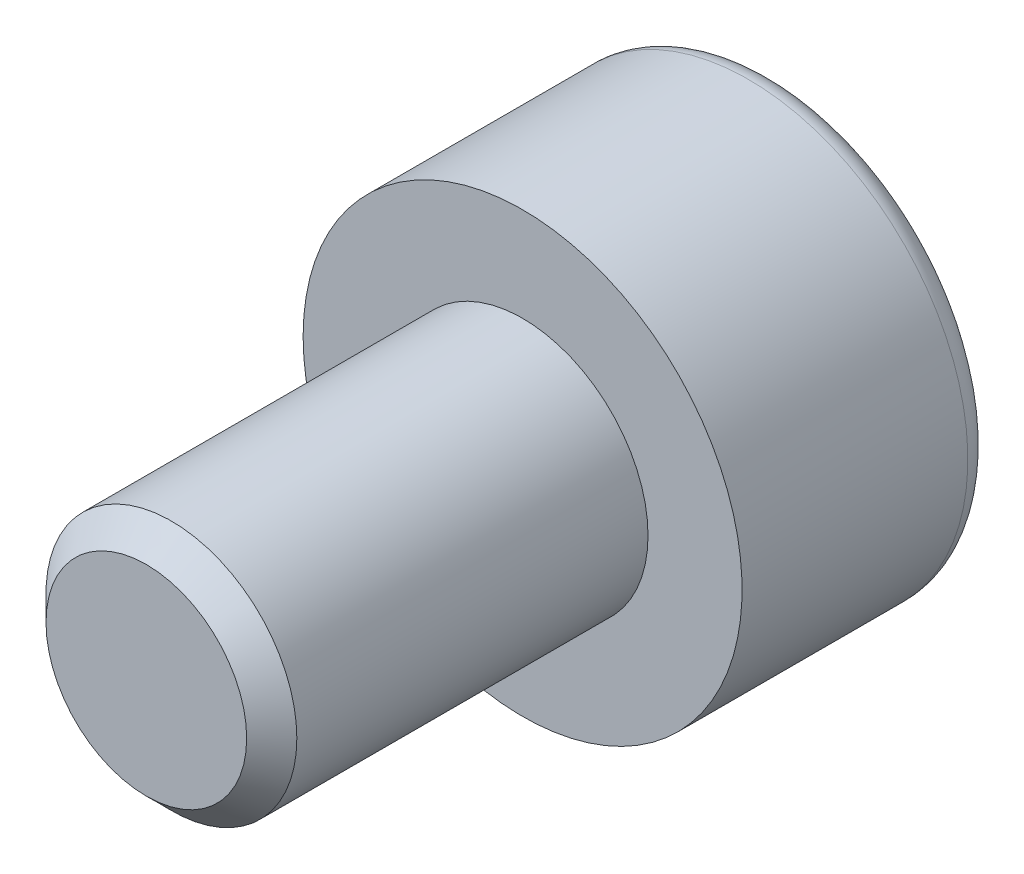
from build123d import *

# Parameters (mm, degrees)
ENLEV_MAT_EXTRU1_DEPTH = 2
ESQUISSE3_W            = 2
ESQUISSE3_H            = 6
CHANFREIN1_SIZE        = 0.4


with BuildPart() as part:
    # Esquisse1 → Base-R_volution (revolve)
    with BuildSketch(Plane(origin=(0, 0, 0), x_dir=(1, 0, 0), z_dir=(0, 1, 0)), mode=Mode.PRIVATE) as base_r_volution_sk:
        with BuildLine():
            Line((0, 0), (3.5, 0))
            Line((3.5, 0), (3.5, 3.6))
            ThreePointArc((3.5, 3.6), (3.382842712, 3.882842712), (3.1, 4))
            Line((3.1, 4), (0, 4))
            Line((0, 4), (0, 0))
        make_face()
    revolve(base_r_volution_sk.sketch.rotate(Axis((0, 0, 0), (0, 0, -1)), 180), axis=Axis((0, 0, 0), (0, 0, -1)))

    # Esquisse2 → enlev-mat-Extru1 (cut)
    with BuildSketch(Plane.XY.offset(-4)):
        Polygon((1.5, -0.866025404), (1.5, 0.866025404), (0, 1.732050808), (-1.5, 0.866025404), (-1.5, -0.866025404), (0, -1.732050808), align=None)
    extrude(amount=ENLEV_MAT_EXTRU1_DEPTH, mode=Mode.SUBTRACT)

    # Esquisse3 → Boss.-R_vol.1 (revolve)
    with BuildSketch(Plane(origin=(0, 0, 0), x_dir=(1, 0, 0), z_dir=(0, 1, 0))):
        with Locations((1, -3)):
            Rectangle(ESQUISSE3_W, ESQUISSE3_H)
    revolve(axis=Axis((0, 0, 0), (0, 0, 1)))

    # Chanfrein1
    chanfrein1_edges = [part.edges().sort_by_distance(p)[0] for p in [
        (-2, 0, 6),
    ]]
    chamfer(chanfrein1_edges, length=CHANFREIN1_SIZE)


solid = part.part
